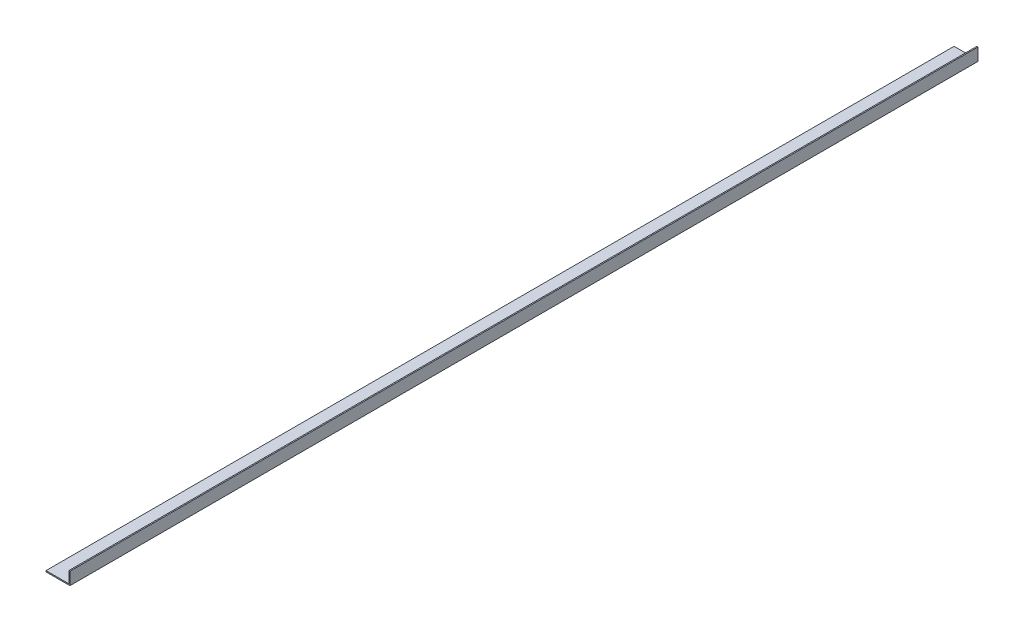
ISO-10303-21;
HEADER;
FILE_DESCRIPTION(('STEP AP214'),'2;1');
FILE_NAME('part.step','',(''),(''),'','','');
FILE_SCHEMA(('AUTOMOTIVE_DESIGN { 1 0 10303 214 1 1 1 1 }'));
ENDSEC;
DATA;
#1=APPLICATION_CONTEXT('core data for automotive mechanical design processes');
#2=APPLICATION_PROTOCOL_DEFINITION('international standard','automotive_design',2000,#1);
#3=PRODUCT_CONTEXT('',#1,'mechanical');
#4=PRODUCT('Part','Part','',(#3));
#5=PRODUCT_RELATED_PRODUCT_CATEGORY('part','',(#4));
#6=PRODUCT_DEFINITION_FORMATION('','',#4);
#7=PRODUCT_DEFINITION_CONTEXT('part definition',#1,'design');
#8=PRODUCT_DEFINITION('design','',#6,#7);
#9=PRODUCT_DEFINITION_SHAPE('','',#8);
#10=(LENGTH_UNIT() NAMED_UNIT(*) SI_UNIT(.MILLI.,.METRE.));
#11=(NAMED_UNIT(*) PLANE_ANGLE_UNIT() SI_UNIT($,.RADIAN.));
#12=(NAMED_UNIT(*) SI_UNIT($,.STERADIAN.) SOLID_ANGLE_UNIT());
#13=UNCERTAINTY_MEASURE_WITH_UNIT(LENGTH_MEASURE(1.E-05),#10,'distance_accuracy_value','');
#14=(GEOMETRIC_REPRESENTATION_CONTEXT(3) GLOBAL_UNCERTAINTY_ASSIGNED_CONTEXT((#13)) GLOBAL_UNIT_ASSIGNED_CONTEXT((#10,
#11,#12)) REPRESENTATION_CONTEXT('',''));
#15=CARTESIAN_POINT('',(0.,0.,0.));
#16=DIRECTION('',(0.,0.,1.));
#17=DIRECTION('',(1.,0.,0.));
#18=AXIS2_PLACEMENT_3D('',#15,#16,#17);
#19=CARTESIAN_POINT('',(47.4999999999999,3938.85292152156,-1196.56406460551));
#20=DIRECTION('',(1.,0.,0.));
#21=DIRECTION('',(0.,0.,-1.));
#22=AXIS2_PLACEMENT_3D('',#19,#20,#21);
#23=PLANE('',#22);
#24=DIRECTION('',(0.,1.,0.));
#25=VECTOR('',#24,1.);
#26=CARTESIAN_POINT('',(47.4999999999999,3938.85292152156,0.));
#27=LINE('',#26,#25);
#28=CARTESIAN_POINT('',(47.4999999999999,3938.85292152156,0.));
#29=VERTEX_POINT('',#28);
#30=CARTESIAN_POINT('',(47.4999999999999,3955.35292152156,0.));
#31=VERTEX_POINT('',#30);
#32=EDGE_CURVE('E76',#29,#31,#27,.T.);
#33=ORIENTED_EDGE('',*,*,#32,.F.);
#34=DIRECTION('',(0.,0.,1.));
#35=VECTOR('',#34,1.);
#36=CARTESIAN_POINT('',(47.4999999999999,3938.85292152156,-1196.56406460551));
#37=LINE('',#36,#35);
#38=CARTESIAN_POINT('',(47.4999999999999,3938.85292152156,-1196.56406460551));
#39=VERTEX_POINT('',#38);
#40=EDGE_CURVE('E11',#39,#29,#37,.T.);
#41=ORIENTED_EDGE('',*,*,#40,.F.);
#42=DIRECTION('',(0.,1.,0.));
#43=VECTOR('',#42,1.);
#44=CARTESIAN_POINT('',(47.4999999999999,3938.85292152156,-1196.56406460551));
#45=LINE('',#44,#43);
#46=CARTESIAN_POINT('',(47.4999999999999,3955.35292152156,-1196.56406460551));
#47=VERTEX_POINT('',#46);
#48=EDGE_CURVE('E78',#39,#47,#45,.T.);
#49=ORIENTED_EDGE('',*,*,#48,.T.);
#50=DIRECTION('',(0.,0.,1.));
#51=VECTOR('',#50,1.);
#52=CARTESIAN_POINT('',(47.4999999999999,3955.35292152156,-1196.56406460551));
#53=LINE('',#52,#51);
#54=EDGE_CURVE('E27',#47,#31,#53,.T.);
#55=ORIENTED_EDGE('',*,*,#54,.T.);
#56=EDGE_LOOP('',(#33,#41,#49,#55));
#57=FACE_BOUND('',#56,.T.);
#58=ADVANCED_FACE('F24',(#57),#23,.T.);
#59=CARTESIAN_POINT('',(16.,3938.85292152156,-1196.56406460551));
#60=DIRECTION('',(0.,-1.,0.));
#61=DIRECTION('',(0.,0.,-1.));
#62=AXIS2_PLACEMENT_3D('',#59,#60,#61);
#63=PLANE('',#62);
#64=DIRECTION('',(1.,0.,0.));
#65=VECTOR('',#64,1.);
#66=CARTESIAN_POINT('',(16.,3938.85292152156,0.));
#67=LINE('',#66,#65);
#68=CARTESIAN_POINT('',(16.,3938.85292152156,0.));
#69=VERTEX_POINT('',#68);
#70=EDGE_CURVE('E94',#69,#29,#67,.T.);
#71=ORIENTED_EDGE('',*,*,#70,.F.);
#72=DIRECTION('',(0.,0.,1.));
#73=VECTOR('',#72,1.);
#74=CARTESIAN_POINT('',(16.,3938.85292152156,-1196.56406460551));
#75=LINE('',#74,#73);
#76=CARTESIAN_POINT('',(16.,3938.85292152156,-1196.56406460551));
#77=VERTEX_POINT('',#76);
#78=EDGE_CURVE('E32',#77,#69,#75,.T.);
#79=ORIENTED_EDGE('',*,*,#78,.F.);
#80=DIRECTION('',(1.,0.,0.));
#81=VECTOR('',#80,1.);
#82=CARTESIAN_POINT('',(16.,3938.85292152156,-1196.56406460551));
#83=LINE('',#82,#81);
#84=EDGE_CURVE('E83',#77,#39,#83,.T.);
#85=ORIENTED_EDGE('',*,*,#84,.T.);
#86=ORIENTED_EDGE('',*,*,#40,.T.);
#87=EDGE_LOOP('',(#71,#79,#85,#86));
#88=FACE_BOUND('',#87,.T.);
#89=ADVANCED_FACE('F129',(#88),#63,.T.);
#90=CARTESIAN_POINT('',(16.,3940.35292152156,-1196.56406460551));
#91=DIRECTION('',(-1.,0.,0.));
#92=DIRECTION('',(0.,0.,1.));
#93=AXIS2_PLACEMENT_3D('',#90,#91,#92);
#94=PLANE('',#93);
#95=DIRECTION('',(0.,-1.,0.));
#96=VECTOR('',#95,1.);
#97=CARTESIAN_POINT('',(16.,3940.35292152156,0.));
#98=LINE('',#97,#96);
#99=CARTESIAN_POINT('',(16.,3940.35292152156,0.));
#100=VERTEX_POINT('',#99);
#101=EDGE_CURVE('E101',#100,#69,#98,.T.);
#102=ORIENTED_EDGE('',*,*,#101,.F.);
#103=DIRECTION('',(0.,0.,1.));
#104=VECTOR('',#103,1.);
#105=CARTESIAN_POINT('',(16.,3940.35292152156,-1196.56406460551));
#106=LINE('',#105,#104);
#107=CARTESIAN_POINT('',(16.,3940.35292152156,-1196.56406460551));
#108=VERTEX_POINT('',#107);
#109=EDGE_CURVE('E117',#108,#100,#106,.T.);
#110=ORIENTED_EDGE('',*,*,#109,.F.);
#111=DIRECTION('',(0.,-1.,0.));
#112=VECTOR('',#111,1.);
#113=CARTESIAN_POINT('',(16.,3940.35292152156,-1196.56406460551));
#114=LINE('',#113,#112);
#115=EDGE_CURVE('E113',#108,#77,#114,.T.);
#116=ORIENTED_EDGE('',*,*,#115,.T.);
#117=ORIENTED_EDGE('',*,*,#78,.T.);
#118=EDGE_LOOP('',(#102,#110,#116,#117));
#119=FACE_BOUND('',#118,.T.);
#120=ADVANCED_FACE('F134',(#119),#94,.T.);
#121=CARTESIAN_POINT('',(16.,3940.35292152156,-1196.56406460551));
#122=DIRECTION('',(0.,1.,0.));
#123=DIRECTION('',(0.,0.,1.));
#124=AXIS2_PLACEMENT_3D('',#121,#122,#123);
#125=PLANE('',#124);
#126=DIRECTION('',(-1.,0.,0.));
#127=VECTOR('',#126,1.);
#128=CARTESIAN_POINT('',(16.,3940.35292152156,0.));
#129=LINE('',#128,#127);
#130=CARTESIAN_POINT('',(45.9999999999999,3940.35292152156,0.));
#131=VERTEX_POINT('',#130);
#132=EDGE_CURVE('E98',#131,#100,#129,.T.);
#133=ORIENTED_EDGE('',*,*,#132,.F.);
#134=DIRECTION('',(0.,0.,1.));
#135=VECTOR('',#134,1.);
#136=CARTESIAN_POINT('',(45.9999999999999,3940.35292152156,-1196.56406460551));
#137=LINE('',#136,#135);
#138=CARTESIAN_POINT('',(45.9999999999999,3940.35292152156,-1196.56406460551));
#139=VERTEX_POINT('',#138);
#140=EDGE_CURVE('E119',#139,#131,#137,.T.);
#141=ORIENTED_EDGE('',*,*,#140,.F.);
#142=DIRECTION('',(-1.,0.,0.));
#143=VECTOR('',#142,1.);
#144=CARTESIAN_POINT('',(16.,3940.35292152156,-1196.56406460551));
#145=LINE('',#144,#143);
#146=EDGE_CURVE('E110',#139,#108,#145,.T.);
#147=ORIENTED_EDGE('',*,*,#146,.T.);
#148=ORIENTED_EDGE('',*,*,#109,.T.);
#149=EDGE_LOOP('',(#133,#141,#147,#148));
#150=FACE_BOUND('',#149,.T.);
#151=ADVANCED_FACE('F126',(#150),#125,.T.);
#152=CARTESIAN_POINT('',(45.9999999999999,3940.35292152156,-1196.56406460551));
#153=DIRECTION('',(-1.,0.,0.));
#154=DIRECTION('',(0.,0.,1.));
#155=AXIS2_PLACEMENT_3D('',#152,#153,#154);
#156=PLANE('',#155);
#157=DIRECTION('',(0.,-1.,0.));
#158=VECTOR('',#157,1.);
#159=CARTESIAN_POINT('',(45.9999999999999,3940.35292152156,0.));
#160=LINE('',#159,#158);
#161=CARTESIAN_POINT('',(45.9999999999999,3955.35292152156,0.));
#162=VERTEX_POINT('',#161);
#163=EDGE_CURVE('E90',#162,#131,#160,.T.);
#164=ORIENTED_EDGE('',*,*,#163,.F.);
#165=DIRECTION('',(0.,0.,1.));
#166=VECTOR('',#165,1.);
#167=CARTESIAN_POINT('',(45.9999999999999,3955.35292152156,-1196.56406460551));
#168=LINE('',#167,#166);
#169=CARTESIAN_POINT('',(45.9999999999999,3955.35292152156,-1196.56406460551));
#170=VERTEX_POINT('',#169);
#171=EDGE_CURVE('E82',#170,#162,#168,.T.);
#172=ORIENTED_EDGE('',*,*,#171,.F.);
#173=DIRECTION('',(0.,-1.,0.));
#174=VECTOR('',#173,1.);
#175=CARTESIAN_POINT('',(45.9999999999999,3940.35292152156,-1196.56406460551));
#176=LINE('',#175,#174);
#177=EDGE_CURVE('E107',#170,#139,#176,.T.);
#178=ORIENTED_EDGE('',*,*,#177,.T.);
#179=ORIENTED_EDGE('',*,*,#140,.T.);
#180=EDGE_LOOP('',(#164,#172,#178,#179));
#181=FACE_BOUND('',#180,.T.);
#182=ADVANCED_FACE('F122',(#181),#156,.T.);
#183=CARTESIAN_POINT('',(45.9999999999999,3955.35292152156,-1196.56406460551));
#184=DIRECTION('',(0.,1.,0.));
#185=DIRECTION('',(0.,0.,1.));
#186=AXIS2_PLACEMENT_3D('',#183,#184,#185);
#187=PLANE('',#186);
#188=DIRECTION('',(-1.,0.,0.));
#189=VECTOR('',#188,1.);
#190=CARTESIAN_POINT('',(45.9999999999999,3955.35292152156,0.));
#191=LINE('',#190,#189);
#192=EDGE_CURVE('E85',#31,#162,#191,.T.);
#193=ORIENTED_EDGE('',*,*,#192,.F.);
#194=ORIENTED_EDGE('',*,*,#54,.F.);
#195=DIRECTION('',(-1.,0.,0.));
#196=VECTOR('',#195,1.);
#197=CARTESIAN_POINT('',(45.9999999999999,3955.35292152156,-1196.56406460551));
#198=LINE('',#197,#196);
#199=EDGE_CURVE('E105',#47,#170,#198,.T.);
#200=ORIENTED_EDGE('',*,*,#199,.T.);
#201=ORIENTED_EDGE('',*,*,#171,.T.);
#202=EDGE_LOOP('',(#193,#194,#200,#201));
#203=FACE_BOUND('',#202,.T.);
#204=ADVANCED_FACE('F86',(#203),#187,.T.);
#205=CARTESIAN_POINT('',(47.4999999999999,3955.35292152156,-1196.56406460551));
#206=DIRECTION('',(0.,0.,-1.));
#207=DIRECTION('',(-1.,0.,0.));
#208=AXIS2_PLACEMENT_3D('',#205,#206,#207);
#209=PLANE('',#208);
#210=ORIENTED_EDGE('',*,*,#48,.F.);
#211=ORIENTED_EDGE('',*,*,#84,.F.);
#212=ORIENTED_EDGE('',*,*,#115,.F.);
#213=ORIENTED_EDGE('',*,*,#146,.F.);
#214=ORIENTED_EDGE('',*,*,#177,.F.);
#215=ORIENTED_EDGE('',*,*,#199,.F.);
#216=EDGE_LOOP('',(#210,#211,#212,#213,#214,#215));
#217=FACE_BOUND('',#216,.T.);
#218=ADVANCED_FACE('F133',(#217),#209,.T.);
#219=CARTESIAN_POINT('',(47.4999999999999,3955.35292152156,0.));
#220=DIRECTION('',(0.,0.,-1.));
#221=DIRECTION('',(-1.,0.,0.));
#222=AXIS2_PLACEMENT_3D('',#219,#220,#221);
#223=PLANE('',#222);
#224=ORIENTED_EDGE('',*,*,#32,.T.);
#225=ORIENTED_EDGE('',*,*,#192,.T.);
#226=ORIENTED_EDGE('',*,*,#163,.T.);
#227=ORIENTED_EDGE('',*,*,#132,.T.);
#228=ORIENTED_EDGE('',*,*,#101,.T.);
#229=ORIENTED_EDGE('',*,*,#70,.T.);
#230=EDGE_LOOP('',(#224,#225,#226,#227,#228,#229));
#231=FACE_BOUND('',#230,.T.);
#232=ADVANCED_FACE('F92',(#231),#223,.F.);
#233=CLOSED_SHELL('',(#58,#89,#120,#151,#182,#204,#218,#232));
#234=MANIFOLD_SOLID_BREP('B2',#233);
#235=ADVANCED_BREP_SHAPE_REPRESENTATION('',(#18,#234),#14);
#236=SHAPE_DEFINITION_REPRESENTATION(#9,#235);
ENDSEC;
END-ISO-10303-21;
